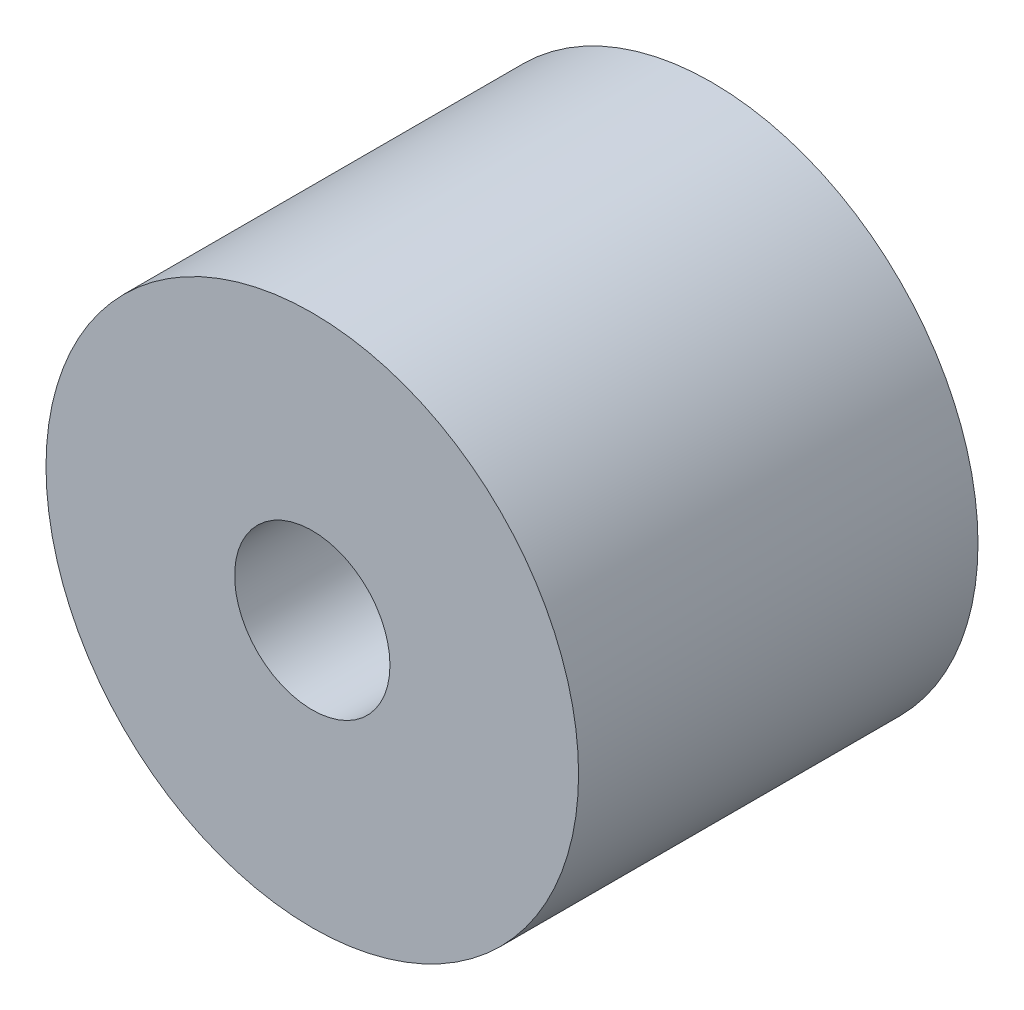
from build123d import *

# Parameters (mm, degrees)
ESQUISSE1_R        = 6
ESQUISSE1_R_2      = 1.75
BOSS_EXTRU_1_DEPTH = 9


with BuildPart() as part:
    # Esquisse1 → Boss.-Extru.1 (new body)
    with BuildSketch(Plane.XY):
        Circle(ESQUISSE1_R)
        Circle(ESQUISSE1_R_2, mode=Mode.SUBTRACT)
    extrude(amount=BOSS_EXTRU_1_DEPTH)


solid = part.part
